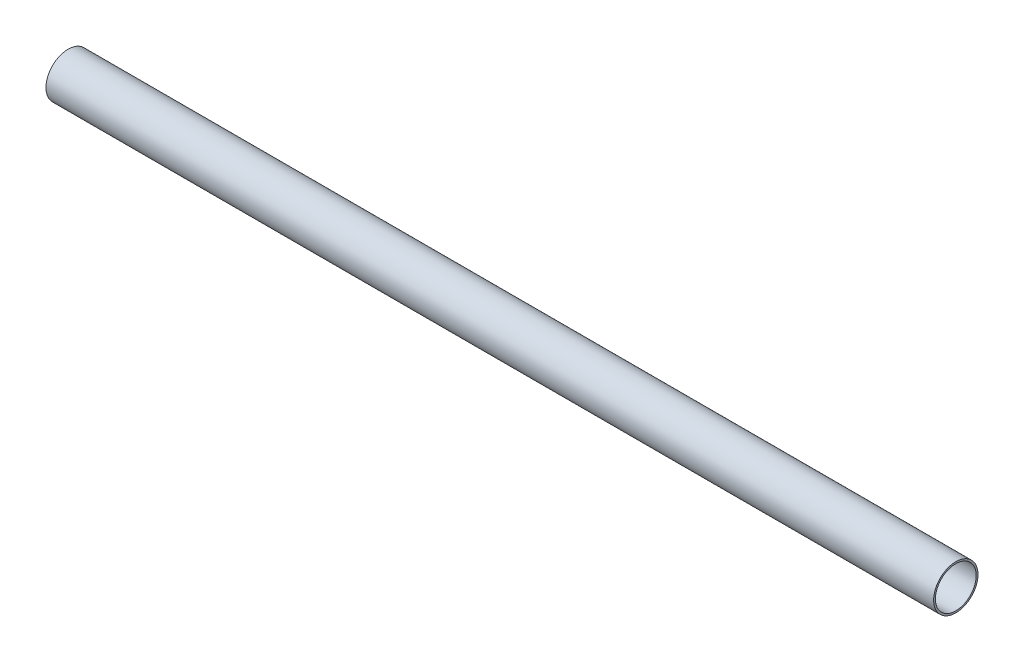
from build123d import *

# Parameters (mm, degrees)
SKETCH12_R                                     = 25
SKETCH12_R_2                                   = 23
KULJETINRULLAT_50X2_1_8075_KULJETINRULLA_DEPTH = 1000


with BuildPart() as part:
    # Sketch12 → Kuljetinrullat 50x2 1.8075 KULJETINRULLA (new body)
    with BuildSketch(Plane(origin=(0, 0, 0), x_dir=(0, 0, -1), z_dir=(1, 0, 0))):
        Circle(SKETCH12_R)
        Circle(SKETCH12_R_2, mode=Mode.SUBTRACT)
    extrude(amount=KULJETINRULLAT_50X2_1_8075_KULJETINRULLA_DEPTH)


solid = part.part
